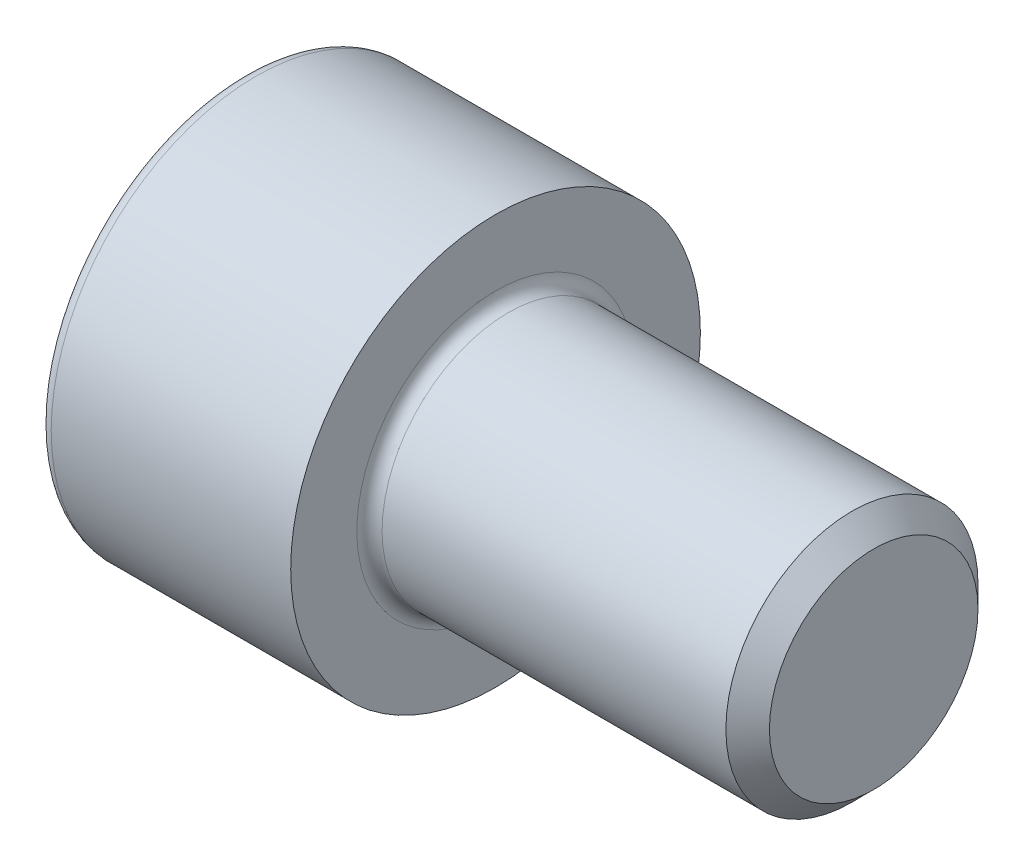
ISO-10303-21;
HEADER;
FILE_DESCRIPTION(('STEP AP214'),'2;1');
FILE_NAME('part.step','',(''),(''),'','','');
FILE_SCHEMA(('AUTOMOTIVE_DESIGN { 1 0 10303 214 1 1 1 1 }'));
ENDSEC;
DATA;
#1=APPLICATION_CONTEXT('core data for automotive mechanical design processes');
#2=APPLICATION_PROTOCOL_DEFINITION('international standard','automotive_design',2000,#1);
#3=PRODUCT_CONTEXT('',#1,'mechanical');
#4=PRODUCT('Part','Part','',(#3));
#5=PRODUCT_RELATED_PRODUCT_CATEGORY('part','',(#4));
#6=PRODUCT_DEFINITION_FORMATION('','',#4);
#7=PRODUCT_DEFINITION_CONTEXT('part definition',#1,'design');
#8=PRODUCT_DEFINITION('design','',#6,#7);
#9=PRODUCT_DEFINITION_SHAPE('','',#8);
#10=(LENGTH_UNIT() NAMED_UNIT(*) SI_UNIT(.MILLI.,.METRE.));
#11=(NAMED_UNIT(*) PLANE_ANGLE_UNIT() SI_UNIT($,.RADIAN.));
#12=(NAMED_UNIT(*) SI_UNIT($,.STERADIAN.) SOLID_ANGLE_UNIT());
#13=UNCERTAINTY_MEASURE_WITH_UNIT(LENGTH_MEASURE(1.E-05),#10,'distance_accuracy_value','');
#14=(GEOMETRIC_REPRESENTATION_CONTEXT(3) GLOBAL_UNCERTAINTY_ASSIGNED_CONTEXT((#13)) GLOBAL_UNIT_ASSIGNED_CONTEXT((#10,
#11,#12)) REPRESENTATION_CONTEXT('',''));
#15=CARTESIAN_POINT('',(0.,0.,0.));
#16=DIRECTION('',(0.,0.,1.));
#17=DIRECTION('',(1.,0.,0.));
#18=AXIS2_PLACEMENT_3D('',#15,#16,#17);
#19=CARTESIAN_POINT('',(0.,0.,0.));
#20=DIRECTION('',(-1.,0.,0.));
#21=DIRECTION('',(0.,0.,1.));
#22=AXIS2_PLACEMENT_3D('',#19,#20,#21);
#23=PLANE('',#22);
#24=DIRECTION('',(0.,-0.499999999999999,0.866025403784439));
#25=VECTOR('',#24,1.);
#26=CARTESIAN_POINT('',(0.,3.51894989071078,0.));
#27=LINE('',#26,#25);
#28=CARTESIAN_POINT('',(0.,3.51894989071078,0.));
#29=VERTEX_POINT('',#28);
#30=CARTESIAN_POINT('',(0.,1.75947494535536,3.04749999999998));
#31=VERTEX_POINT('',#30);
#32=EDGE_CURVE('E257',#29,#31,#27,.T.);
#33=ORIENTED_EDGE('',*,*,#32,.T.);
#34=DIRECTION('',(0.,1.,0.));
#35=VECTOR('',#34,1.);
#36=CARTESIAN_POINT('',(0.,-1.75947494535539,3.04750000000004));
#37=LINE('',#36,#35);
#38=CARTESIAN_POINT('',(0.,-1.75947494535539,3.04750000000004));
#39=VERTEX_POINT('',#38);
#40=EDGE_CURVE('E129',#39,#31,#37,.T.);
#41=ORIENTED_EDGE('',*,*,#40,.F.);
#42=DIRECTION('',(0.,-0.500000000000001,-0.866025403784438));
#43=VECTOR('',#42,1.);
#44=CARTESIAN_POINT('',(0.,-1.75947494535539,3.04750000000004));
#45=LINE('',#44,#43);
#46=CARTESIAN_POINT('',(0.,-3.51894989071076,0.));
#47=VERTEX_POINT('',#46);
#48=EDGE_CURVE('E260',#39,#47,#45,.T.);
#49=ORIENTED_EDGE('',*,*,#48,.T.);
#50=DIRECTION('',(0.,0.499999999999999,-0.866025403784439));
#51=VECTOR('',#50,1.);
#52=CARTESIAN_POINT('',(0.,-3.51894989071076,0.));
#53=LINE('',#52,#51);
#54=CARTESIAN_POINT('',(0.,-1.75947494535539,-3.04750000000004));
#55=VERTEX_POINT('',#54);
#56=EDGE_CURVE('E263',#47,#55,#53,.T.);
#57=ORIENTED_EDGE('',*,*,#56,.T.);
#58=DIRECTION('',(0.,-1.,0.));
#59=VECTOR('',#58,1.);
#60=CARTESIAN_POINT('',(0.,1.75947494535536,-3.04749999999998));
#61=LINE('',#60,#59);
#62=CARTESIAN_POINT('',(0.,1.75947494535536,-3.04749999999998));
#63=VERTEX_POINT('',#62);
#64=EDGE_CURVE('E266',#63,#55,#61,.T.);
#65=ORIENTED_EDGE('',*,*,#64,.F.);
#66=DIRECTION('',(0.,-0.500000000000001,-0.866025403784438));
#67=VECTOR('',#66,1.);
#68=CARTESIAN_POINT('',(0.,3.51894989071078,0.));
#69=LINE('',#68,#67);
#70=EDGE_CURVE('E124',#29,#63,#69,.T.);
#71=ORIENTED_EDGE('',*,*,#70,.F.);
#72=EDGE_LOOP('',(#33,#41,#49,#57,#65,#71));
#73=FACE_BOUND('',#72,.T.);
#74=CARTESIAN_POINT('',(0.,0.,0.));
#75=DIRECTION('',(-1.,0.,0.));
#76=DIRECTION('',(0.,0.,1.));
#77=AXIS2_PLACEMENT_3D('',#74,#75,#76);
#78=CIRCLE('',#77,6.1);
#79=CARTESIAN_POINT('',(0.,0.,6.1));
#80=VERTEX_POINT('',#79);
#81=EDGE_CURVE('E41',#80,#80,#78,.T.);
#82=ORIENTED_EDGE('',*,*,#81,.T.);
#83=EDGE_LOOP('',(#82));
#84=FACE_BOUND('',#83,.T.);
#85=ADVANCED_FACE('F33',(#73,#84),#23,.T.);
#86=CARTESIAN_POINT('',(-31.7499999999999,0.,0.));
#87=DIRECTION('',(-1.,0.,0.));
#88=DIRECTION('',(0.,0.,1.));
#89=AXIS2_PLACEMENT_3D('',#86,#87,#88);
#90=CYLINDRICAL_SURFACE('',#89,6.5);
#91=CARTESIAN_POINT('',(0.399999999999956,0.,0.));
#92=DIRECTION('',(-1.,0.,0.));
#93=DIRECTION('',(0.,0.,1.));
#94=AXIS2_PLACEMENT_3D('',#91,#92,#93);
#95=CIRCLE('',#94,6.5);
#96=CARTESIAN_POINT('',(0.399999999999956,0.,6.5));
#97=VERTEX_POINT('',#96);
#98=EDGE_CURVE('E11',#97,#97,#95,.F.);
#99=ORIENTED_EDGE('',*,*,#98,.T.);
#100=EDGE_LOOP('',(#99));
#101=FACE_BOUND('',#100,.T.);
#102=CARTESIAN_POINT('',(8.00000000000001,0.,0.));
#103=DIRECTION('',(-1.,0.,0.));
#104=DIRECTION('',(0.,0.,1.));
#105=AXIS2_PLACEMENT_3D('',#102,#103,#104);
#106=CIRCLE('',#105,6.5);
#107=CARTESIAN_POINT('',(8.00000000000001,0.,6.5));
#108=VERTEX_POINT('',#107);
#109=EDGE_CURVE('E147',#108,#108,#106,.T.);
#110=ORIENTED_EDGE('',*,*,#109,.T.);
#111=EDGE_LOOP('',(#110));
#112=FACE_BOUND('',#111,.T.);
#113=ADVANCED_FACE('F171',(#101,#112),#90,.T.);
#114=CARTESIAN_POINT('',(8.00000000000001,6.50000000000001,0.));
#115=DIRECTION('',(1.,0.,0.));
#116=DIRECTION('',(0.,0.,-1.));
#117=AXIS2_PLACEMENT_3D('',#114,#115,#116);
#118=PLANE('',#117);
#119=CARTESIAN_POINT('',(8.00000000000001,0.,0.));
#120=DIRECTION('',(1.,0.,0.));
#121=DIRECTION('',(0.,0.,-1.));
#122=AXIS2_PLACEMENT_3D('',#119,#120,#121);
#123=CIRCLE('',#122,4.39999999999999);
#124=CARTESIAN_POINT('',(8.00000000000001,0.,-4.39999999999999));
#125=VERTEX_POINT('',#124);
#126=EDGE_CURVE('E150',#125,#125,#123,.F.);
#127=ORIENTED_EDGE('',*,*,#126,.T.);
#128=EDGE_LOOP('',(#127));
#129=FACE_BOUND('',#128,.T.);
#130=ORIENTED_EDGE('',*,*,#109,.F.);
#131=EDGE_LOOP('',(#130));
#132=FACE_BOUND('',#131,.T.);
#133=ADVANCED_FACE('F177',(#129,#132),#118,.T.);
#134=CARTESIAN_POINT('',(-31.7499999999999,0.,0.));
#135=DIRECTION('',(-1.,0.,0.));
#136=DIRECTION('',(0.,0.,1.));
#137=AXIS2_PLACEMENT_3D('',#134,#135,#136);
#138=CYLINDRICAL_SURFACE('',#137,3.99999999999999);
#139=CARTESIAN_POINT('',(8.39999999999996,0.,0.));
#140=DIRECTION('',(1.,0.,0.));
#141=DIRECTION('',(0.,0.,-1.));
#142=AXIS2_PLACEMENT_3D('',#139,#140,#141);
#143=CIRCLE('',#142,3.99999999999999);
#144=CARTESIAN_POINT('',(8.39999999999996,0.,-3.99999999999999));
#145=VERTEX_POINT('',#144);
#146=EDGE_CURVE('E153',#145,#145,#143,.T.);
#147=ORIENTED_EDGE('',*,*,#146,.T.);
#148=EDGE_LOOP('',(#147));
#149=FACE_BOUND('',#148,.T.);
#150=CARTESIAN_POINT('',(19.3095000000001,0.,0.));
#151=DIRECTION('',(-1.,0.,0.));
#152=DIRECTION('',(0.,0.,1.));
#153=AXIS2_PLACEMENT_3D('',#150,#151,#152);
#154=CIRCLE('',#153,3.99999999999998);
#155=CARTESIAN_POINT('',(19.3095000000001,0.,3.99999999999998));
#156=VERTEX_POINT('',#155);
#157=EDGE_CURVE('E144',#156,#156,#154,.T.);
#158=ORIENTED_EDGE('',*,*,#157,.T.);
#159=EDGE_LOOP('',(#158));
#160=FACE_BOUND('',#159,.T.);
#161=ADVANCED_FACE('F183',(#149,#160),#138,.T.);
#162=CARTESIAN_POINT('',(20.,0.,0.));
#163=DIRECTION('',(-1.,0.,0.));
#164=DIRECTION('',(0.,0.,1.));
#165=AXIS2_PLACEMENT_3D('',#162,#163,#164);
#166=CONICAL_SURFACE('',#165,3.3095,0.785398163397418);
#167=ORIENTED_EDGE('',*,*,#157,.F.);
#168=EDGE_LOOP('',(#167));
#169=FACE_BOUND('',#168,.T.);
#170=CARTESIAN_POINT('',(20.,0.,0.));
#171=DIRECTION('',(-1.,0.,0.));
#172=DIRECTION('',(0.,0.,1.));
#173=AXIS2_PLACEMENT_3D('',#170,#171,#172);
#174=CIRCLE('',#173,3.3095);
#175=CARTESIAN_POINT('',(20.,0.,3.3095));
#176=VERTEX_POINT('',#175);
#177=EDGE_CURVE('E140',#176,#176,#174,.T.);
#178=ORIENTED_EDGE('',*,*,#177,.T.);
#179=EDGE_LOOP('',(#178));
#180=FACE_BOUND('',#179,.T.);
#181=ADVANCED_FACE('F187',(#169,#180),#166,.T.);
#182=CARTESIAN_POINT('',(20.,3.30949999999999,0.));
#183=DIRECTION('',(1.,0.,0.));
#184=DIRECTION('',(0.,0.,-1.));
#185=AXIS2_PLACEMENT_3D('',#182,#183,#184);
#186=PLANE('',#185);
#187=ORIENTED_EDGE('',*,*,#177,.F.);
#188=EDGE_LOOP('',(#187));
#189=FACE_BOUND('',#188,.T.);
#190=ADVANCED_FACE('F167',(#189),#186,.T.);
#191=CARTESIAN_POINT('',(8.39999999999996,0.,0.));
#192=DIRECTION('',(1.,0.,0.));
#193=DIRECTION('',(0.,0.,-1.));
#194=AXIS2_PLACEMENT_3D('',#191,#192,#193);
#195=TOROIDAL_SURFACE('',#194,4.39999999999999,0.4);
#196=ORIENTED_EDGE('',*,*,#146,.F.);
#197=EDGE_LOOP('',(#196));
#198=FACE_BOUND('',#197,.T.);
#199=ORIENTED_EDGE('',*,*,#126,.F.);
#200=EDGE_LOOP('',(#199));
#201=FACE_BOUND('',#200,.T.);
#202=ADVANCED_FACE('F160',(#198,#201),#195,.F.);
#203=CARTESIAN_POINT('',(0.399999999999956,0.,0.));
#204=DIRECTION('',(-1.,0.,0.));
#205=DIRECTION('',(0.,0.,1.));
#206=AXIS2_PLACEMENT_3D('',#203,#204,#205);
#207=TOROIDAL_SURFACE('',#206,6.1,0.4);
#208=ORIENTED_EDGE('',*,*,#98,.F.);
#209=EDGE_LOOP('',(#208));
#210=FACE_BOUND('',#209,.T.);
#211=ORIENTED_EDGE('',*,*,#81,.F.);
#212=EDGE_LOOP('',(#211));
#213=FACE_BOUND('',#212,.T.);
#214=ADVANCED_FACE('F35',(#210,#213),#207,.T.);
#215=CARTESIAN_POINT('',(4.,3.51894989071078,0.));
#216=DIRECTION('',(0.,-0.866025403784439,-0.499999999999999));
#217=DIRECTION('',(0.,0.499999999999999,-0.866025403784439));
#218=AXIS2_PLACEMENT_3D('',#215,#216,#217);
#219=PLANE('',#218);
#220=ORIENTED_EDGE('',*,*,#32,.F.);
#221=DIRECTION('',(-1.,0.,0.));
#222=VECTOR('',#221,1.);
#223=CARTESIAN_POINT('',(4.,3.51894989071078,0.));
#224=LINE('',#223,#222);
#225=CARTESIAN_POINT('',(4.,3.51894989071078,0.));
#226=VERTEX_POINT('',#225);
#227=EDGE_CURVE('E247',#226,#29,#224,.T.);
#228=ORIENTED_EDGE('',*,*,#227,.F.);
#229=DIRECTION('',(0.,-0.499999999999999,0.866025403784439));
#230=VECTOR('',#229,1.);
#231=CARTESIAN_POINT('',(4.,3.51894989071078,0.));
#232=LINE('',#231,#230);
#233=CARTESIAN_POINT('',(4.,2.63921241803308,1.52374999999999));
#234=VERTEX_POINT('',#233);
#235=EDGE_CURVE('E116',#226,#234,#232,.T.);
#236=ORIENTED_EDGE('',*,*,#235,.T.);
#237=CARTESIAN_POINT('',(4.,1.75947494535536,3.04749999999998));
#238=VERTEX_POINT('',#237);
#239=EDGE_CURVE('E107',#234,#238,#232,.T.);
#240=ORIENTED_EDGE('',*,*,#239,.T.);
#241=DIRECTION('',(-1.,0.,0.));
#242=VECTOR('',#241,1.);
#243=CARTESIAN_POINT('',(4.,1.75947494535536,3.04749999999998));
#244=LINE('',#243,#242);
#245=EDGE_CURVE('E121',#238,#31,#244,.T.);
#246=ORIENTED_EDGE('',*,*,#245,.T.);
#247=EDGE_LOOP('',(#220,#228,#236,#240,#246));
#248=FACE_BOUND('',#247,.T.);
#249=ADVANCED_FACE('F120',(#248),#219,.T.);
#250=CARTESIAN_POINT('',(4.,-1.75947494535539,3.04750000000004));
#251=DIRECTION('',(0.,0.,1.));
#252=DIRECTION('',(0.,-1.,0.));
#253=AXIS2_PLACEMENT_3D('',#250,#251,#252);
#254=PLANE('',#253);
#255=ORIENTED_EDGE('',*,*,#40,.T.);
#256=ORIENTED_EDGE('',*,*,#245,.F.);
#257=DIRECTION('',(0.,1.,0.));
#258=VECTOR('',#257,1.);
#259=CARTESIAN_POINT('',(4.,-1.75947494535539,3.04750000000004));
#260=LINE('',#259,#258);
#261=CARTESIAN_POINT('',(4.,0.,3.04749999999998));
#262=VERTEX_POINT('',#261);
#263=EDGE_CURVE('E104',#262,#238,#260,.T.);
#264=ORIENTED_EDGE('',*,*,#263,.F.);
#265=CARTESIAN_POINT('',(4.,-1.75947494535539,3.04750000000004));
#266=VERTEX_POINT('',#265);
#267=EDGE_CURVE('E115',#266,#262,#260,.T.);
#268=ORIENTED_EDGE('',*,*,#267,.F.);
#269=DIRECTION('',(-1.,0.,0.));
#270=VECTOR('',#269,1.);
#271=CARTESIAN_POINT('',(4.,-1.75947494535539,3.04750000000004));
#272=LINE('',#271,#270);
#273=EDGE_CURVE('E131',#266,#39,#272,.T.);
#274=ORIENTED_EDGE('',*,*,#273,.T.);
#275=EDGE_LOOP('',(#255,#256,#264,#268,#274));
#276=FACE_BOUND('',#275,.T.);
#277=ADVANCED_FACE('F126',(#276),#254,.F.);
#278=CARTESIAN_POINT('',(4.,-1.75947494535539,3.04750000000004));
#279=DIRECTION('',(0.,0.866025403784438,-0.500000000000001));
#280=DIRECTION('',(0.,0.500000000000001,0.866025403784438));
#281=AXIS2_PLACEMENT_3D('',#278,#279,#280);
#282=PLANE('',#281);
#283=ORIENTED_EDGE('',*,*,#48,.F.);
#284=ORIENTED_EDGE('',*,*,#273,.F.);
#285=DIRECTION('',(0.,-0.500000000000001,-0.866025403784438));
#286=VECTOR('',#285,1.);
#287=CARTESIAN_POINT('',(4.,-1.75947494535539,3.04750000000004));
#288=LINE('',#287,#286);
#289=CARTESIAN_POINT('',(4.,-2.63921241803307,1.52374999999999));
#290=VERTEX_POINT('',#289);
#291=EDGE_CURVE('E286',#266,#290,#288,.T.);
#292=ORIENTED_EDGE('',*,*,#291,.T.);
#293=CARTESIAN_POINT('',(4.,-3.51894989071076,0.));
#294=VERTEX_POINT('',#293);
#295=EDGE_CURVE('E275',#290,#294,#288,.T.);
#296=ORIENTED_EDGE('',*,*,#295,.T.);
#297=DIRECTION('',(-1.,0.,0.));
#298=VECTOR('',#297,1.);
#299=CARTESIAN_POINT('',(4.,-3.51894989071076,0.));
#300=LINE('',#299,#298);
#301=EDGE_CURVE('E136',#294,#47,#300,.T.);
#302=ORIENTED_EDGE('',*,*,#301,.T.);
#303=EDGE_LOOP('',(#283,#284,#292,#296,#302));
#304=FACE_BOUND('',#303,.T.);
#305=ADVANCED_FACE('F201',(#304),#282,.T.);
#306=CARTESIAN_POINT('',(4.,-3.51894989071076,0.));
#307=DIRECTION('',(0.,0.866025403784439,0.499999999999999));
#308=DIRECTION('',(0.,-0.499999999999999,0.866025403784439));
#309=AXIS2_PLACEMENT_3D('',#306,#307,#308);
#310=PLANE('',#309);
#311=ORIENTED_EDGE('',*,*,#56,.F.);
#312=ORIENTED_EDGE('',*,*,#301,.F.);
#313=DIRECTION('',(0.,0.499999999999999,-0.866025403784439));
#314=VECTOR('',#313,1.);
#315=CARTESIAN_POINT('',(4.,-3.51894989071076,0.));
#316=LINE('',#315,#314);
#317=CARTESIAN_POINT('',(4.,-2.63921241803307,-1.52374999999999));
#318=VERTEX_POINT('',#317);
#319=EDGE_CURVE('E253',#294,#318,#316,.T.);
#320=ORIENTED_EDGE('',*,*,#319,.T.);
#321=CARTESIAN_POINT('',(4.,-1.75947494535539,-3.04750000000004));
#322=VERTEX_POINT('',#321);
#323=EDGE_CURVE('E285',#318,#322,#316,.T.);
#324=ORIENTED_EDGE('',*,*,#323,.T.);
#325=DIRECTION('',(-1.,0.,0.));
#326=VECTOR('',#325,1.);
#327=CARTESIAN_POINT('',(4.,-1.75947494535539,-3.04750000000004));
#328=LINE('',#327,#326);
#329=EDGE_CURVE('E246',#322,#55,#328,.T.);
#330=ORIENTED_EDGE('',*,*,#329,.T.);
#331=EDGE_LOOP('',(#311,#312,#320,#324,#330));
#332=FACE_BOUND('',#331,.T.);
#333=ADVANCED_FACE('F204',(#332),#310,.T.);
#334=CARTESIAN_POINT('',(4.,1.75947494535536,-3.04749999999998));
#335=DIRECTION('',(0.,0.,-1.));
#336=DIRECTION('',(0.,1.,0.));
#337=AXIS2_PLACEMENT_3D('',#334,#335,#336);
#338=PLANE('',#337);
#339=ORIENTED_EDGE('',*,*,#64,.T.);
#340=ORIENTED_EDGE('',*,*,#329,.F.);
#341=DIRECTION('',(0.,-1.,0.));
#342=VECTOR('',#341,1.);
#343=CARTESIAN_POINT('',(4.,1.75947494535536,-3.04749999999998));
#344=LINE('',#343,#342);
#345=CARTESIAN_POINT('',(4.,0.,-3.04750000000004));
#346=VERTEX_POINT('',#345);
#347=EDGE_CURVE('E250',#346,#322,#344,.T.);
#348=ORIENTED_EDGE('',*,*,#347,.F.);
#349=CARTESIAN_POINT('',(4.,1.75947494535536,-3.04749999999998));
#350=VERTEX_POINT('',#349);
#351=EDGE_CURVE('E48',#350,#346,#344,.T.);
#352=ORIENTED_EDGE('',*,*,#351,.F.);
#353=DIRECTION('',(-1.,0.,0.));
#354=VECTOR('',#353,1.);
#355=CARTESIAN_POINT('',(4.,1.75947494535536,-3.04749999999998));
#356=LINE('',#355,#354);
#357=EDGE_CURVE('E243',#350,#63,#356,.T.);
#358=ORIENTED_EDGE('',*,*,#357,.T.);
#359=EDGE_LOOP('',(#339,#340,#348,#352,#358));
#360=FACE_BOUND('',#359,.T.);
#361=ADVANCED_FACE('F208',(#360),#338,.F.);
#362=CARTESIAN_POINT('',(4.,3.51894989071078,0.));
#363=DIRECTION('',(0.,0.866025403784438,-0.500000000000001));
#364=DIRECTION('',(0.,0.500000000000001,0.866025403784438));
#365=AXIS2_PLACEMENT_3D('',#362,#363,#364);
#366=PLANE('',#365);
#367=ORIENTED_EDGE('',*,*,#70,.T.);
#368=ORIENTED_EDGE('',*,*,#357,.F.);
#369=DIRECTION('',(0.,-0.500000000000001,-0.866025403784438));
#370=VECTOR('',#369,1.);
#371=CARTESIAN_POINT('',(4.,3.51894989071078,0.));
#372=LINE('',#371,#370);
#373=CARTESIAN_POINT('',(4.,2.63921241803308,-1.52374999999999));
#374=VERTEX_POINT('',#373);
#375=EDGE_CURVE('E233',#374,#350,#372,.T.);
#376=ORIENTED_EDGE('',*,*,#375,.F.);
#377=EDGE_CURVE('E239',#226,#374,#372,.T.);
#378=ORIENTED_EDGE('',*,*,#377,.F.);
#379=ORIENTED_EDGE('',*,*,#227,.T.);
#380=EDGE_LOOP('',(#367,#368,#376,#378,#379));
#381=FACE_BOUND('',#380,.T.);
#382=ADVANCED_FACE('F212',(#381),#366,.F.);
#383=CARTESIAN_POINT('',(4.,3.51894989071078,0.));
#384=DIRECTION('',(1.,0.,0.));
#385=DIRECTION('',(0.,0.,-1.));
#386=AXIS2_PLACEMENT_3D('',#383,#384,#385);
#387=PLANE('',#386);
#388=ORIENTED_EDGE('',*,*,#347,.T.);
#389=ORIENTED_EDGE('',*,*,#323,.F.);
#390=CARTESIAN_POINT('',(4.,0.,0.));
#391=DIRECTION('',(-1.,0.,0.));
#392=DIRECTION('',(0.,0.,1.));
#393=AXIS2_PLACEMENT_3D('',#390,#391,#392);
#394=CIRCLE('',#393,3.0475);
#395=EDGE_CURVE('E281',#346,#318,#394,.T.);
#396=ORIENTED_EDGE('',*,*,#395,.F.);
#397=EDGE_LOOP('',(#388,#389,#396));
#398=FACE_BOUND('',#397,.T.);
#399=ADVANCED_FACE('F216',(#398),#387,.F.);
#400=ORIENTED_EDGE('',*,*,#319,.F.);
#401=ORIENTED_EDGE('',*,*,#295,.F.);
#402=EDGE_CURVE('E134',#318,#290,#394,.T.);
#403=ORIENTED_EDGE('',*,*,#402,.F.);
#404=EDGE_LOOP('',(#400,#401,#403));
#405=FACE_BOUND('',#404,.T.);
#406=ADVANCED_FACE('F219',(#405),#387,.F.);
#407=ORIENTED_EDGE('',*,*,#291,.F.);
#408=ORIENTED_EDGE('',*,*,#267,.T.);
#409=EDGE_CURVE('E130',#290,#262,#394,.T.);
#410=ORIENTED_EDGE('',*,*,#409,.F.);
#411=EDGE_LOOP('',(#407,#408,#410));
#412=FACE_BOUND('',#411,.T.);
#413=ADVANCED_FACE('F224',(#412),#387,.F.);
#414=ORIENTED_EDGE('',*,*,#263,.T.);
#415=ORIENTED_EDGE('',*,*,#239,.F.);
#416=EDGE_CURVE('E110',#262,#234,#394,.T.);
#417=ORIENTED_EDGE('',*,*,#416,.F.);
#418=EDGE_LOOP('',(#414,#415,#417));
#419=FACE_BOUND('',#418,.T.);
#420=ADVANCED_FACE('F106',(#419),#387,.F.);
#421=ORIENTED_EDGE('',*,*,#235,.F.);
#422=ORIENTED_EDGE('',*,*,#377,.T.);
#423=EDGE_CURVE('E141',#234,#374,#394,.T.);
#424=ORIENTED_EDGE('',*,*,#423,.F.);
#425=EDGE_LOOP('',(#421,#422,#424));
#426=FACE_BOUND('',#425,.T.);
#427=ADVANCED_FACE('F227',(#426),#387,.F.);
#428=ORIENTED_EDGE('',*,*,#375,.T.);
#429=ORIENTED_EDGE('',*,*,#351,.T.);
#430=EDGE_CURVE('E236',#374,#346,#394,.T.);
#431=ORIENTED_EDGE('',*,*,#430,.F.);
#432=EDGE_LOOP('',(#428,#429,#431));
#433=FACE_BOUND('',#432,.T.);
#434=ADVANCED_FACE('F197',(#433),#387,.F.);
#435=CARTESIAN_POINT('',(4.,0.,0.));
#436=DIRECTION('',(-1.,0.,0.));
#437=DIRECTION('',(0.,0.,1.));
#438=AXIS2_PLACEMENT_3D('',#435,#436,#437);
#439=CONICAL_SURFACE('',#438,3.0475,1.04719755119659);
#440=CARTESIAN_POINT('',(5.75947494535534,0.,0.));
#441=VERTEX_POINT('',#440);
#442=VERTEX_LOOP('',#441);
#443=FACE_BOUND('',#442,.T.);
#444=ORIENTED_EDGE('',*,*,#416,.T.);
#445=ORIENTED_EDGE('',*,*,#423,.T.);
#446=ORIENTED_EDGE('',*,*,#430,.T.);
#447=ORIENTED_EDGE('',*,*,#395,.T.);
#448=ORIENTED_EDGE('',*,*,#402,.T.);
#449=ORIENTED_EDGE('',*,*,#409,.T.);
#450=EDGE_LOOP('',(#444,#445,#446,#447,#448,#449));
#451=FACE_BOUND('',#450,.T.);
#452=ADVANCED_FACE('F195',(#443,#451),#439,.F.);
#453=CLOSED_SHELL('',(#85,#113,#133,#161,#181,#190,#202,#214,#249,#277,#305,#333,#361,#382,#399,
#406,#413,#420,#427,#434,#452));
#454=MANIFOLD_SOLID_BREP('B2',#453);
#455=ADVANCED_BREP_SHAPE_REPRESENTATION('',(#18,#454),#14);
#456=SHAPE_DEFINITION_REPRESENTATION(#9,#455);
ENDSEC;
END-ISO-10303-21;
